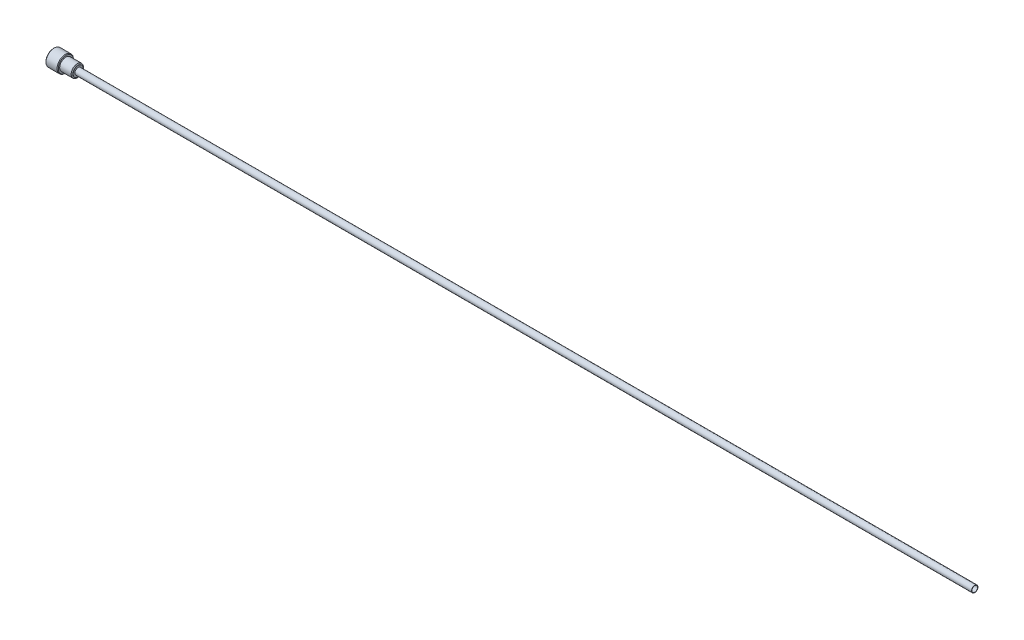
from build123d import *

# Parameters (mm, degrees)
CHAMFER3_SIZE      = 0.3
CHAMFER2_SIZE      = 0.5
CUT_EXTRUDE1_REACH = 452.036


with BuildPart() as part:
    # Sketch1 → Revolve1 (revolve)
    with BuildSketch(Plane.XY, mode=Mode.PRIVATE) as revolve1_sk:
        Polygon((12, 2.44), (11.9, 2.44), (11.576683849, 3), (6, 3), (6, 4), (0, 4), (0, 1.3843), (450, 1.3843), (450, 1.5875), (12, 1.5875), align=None)
    revolve(revolve1_sk.sketch.rotate(Axis((-22.212185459, 0, 0), (1, 0, 0)), 90), axis=Axis((-22.212185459, 0, 0), (1, 0, 0)))

    # Chamfer3
    chamfer3_edges = [part.edges().sort_by_distance(p)[0] for p in [
        (0, 0, -4),
        (6, 0, -4),
    ]]
    chamfer(chamfer3_edges, length=CHAMFER3_SIZE)

    # Sketch6 → Cut-Revolve2 (revolve, cut)
    with BuildSketch(Plane.XY, mode=Mode.PRIVATE) as cut_revolve2_sk:
        Polygon((0, 0), (0, 2.5), (3.8, 2.5), (5.302151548, 0), align=None)
    revolve(cut_revolve2_sk.sketch.rotate(Axis((-8.267465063, 0, 0), (-1, 0, 0)), 270), axis=Axis((-8.267465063, 0, 0), (-1, 0, 0)), mode=Mode.SUBTRACT)

    # Chamfer2
    chamfer2_edges = [part.edges().sort_by_distance(p)[0] for p in [
        (0, 0, -2.5),
    ]]
    chamfer(chamfer2_edges, length=CHAMFER2_SIZE)

    # Cut-Extrude1: up to this cone (the profile starts inside it)
    cut_extrude1_end = Plane(origin=(0, 0, 0), z_dir=(-1, 0, 0)).offset(-5.302150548) * Cone(1.664e-06, 776.656680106, 466.662412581, align=(Align.CENTER, Align.CENTER, Align.MIN), mode=Mode.PRIVATE)
    # Sketch7 → Cut-Extrude1 (cut, up to the surface)
    with BuildSketch(Plane.ZY, mode=Mode.PRIVATE) as cut_extrude1_sk1:
        Polygon((-1.443375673, 2.5), (-2.886751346, 0), (-1.443375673, -2.5), (1.443375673, -2.5), (2.886751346, 0), (1.443375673, 2.5), align=None)
    cut_extrude1_tool1 = extrude(cut_extrude1_sk1.sketch, amount=-CUT_EXTRUDE1_REACH, mode=Mode.PRIVATE) & cut_extrude1_end
    add(cut_extrude1_tool1.solids().sort_by_distance((0, 0, 0))[0], mode=Mode.SUBTRACT)


solid = part.part
